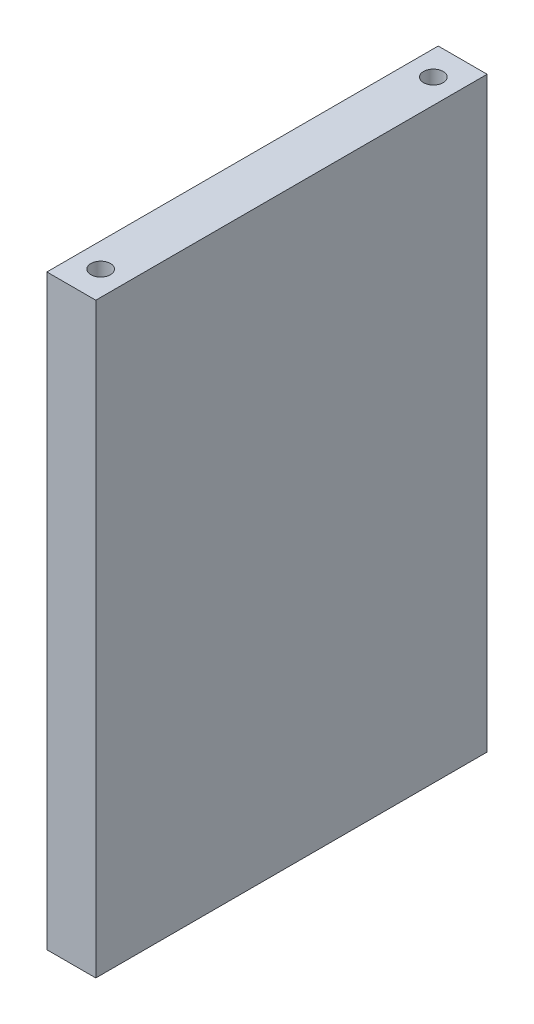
from build123d import *

# Parameters (mm, degrees)
ESQUISSE1_W             = 10
ESQUISSE1_H             = 120
EXTRUSION1_DEPTH        = 80
ESQUISSE2_R             = 2
ENL_V_MAT_EXTRU_1_DEPTH = 10
ESQUISSE4_R             = 2
ENL_V_MAT_EXTRU_2_DEPTH = 10


with BuildPart() as part:
    # Esquisse1 → Extrusion1 (new body)
    with BuildSketch(Plane.XY):
        with Locations((5, 60)):
            Rectangle(ESQUISSE1_W, ESQUISSE1_H)
    extrude(amount=-EXTRUSION1_DEPTH)

    # Esquisse2 → Enl_v. mat.-Extru.1 (cut)
    with BuildSketch(Plane(origin=(0, 120, 0), x_dir=(-1, 0, 0), z_dir=(0, 1, 0))):
        with Locations(Location((-5, -74, 0), (0, 0, 90))):
            Circle(ESQUISSE2_R)
        with Locations(Location((-5, -6, 0), (0, 0, 90))):
            Circle(ESQUISSE2_R)
    extrude(amount=-ENL_V_MAT_EXTRU_1_DEPTH, mode=Mode.SUBTRACT)

    # Esquisse4 → Enl_v. mat.-Extru.2 (cut)
    with BuildSketch(Plane.XZ):
        with Locations(Location((4.974432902, -74, 0), (0, 0, 270))):
            Circle(ESQUISSE4_R)
        with Locations(Location((4.974432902, -6, 0), (0, 0, 270))):
            Circle(ESQUISSE4_R)
    extrude(amount=-ENL_V_MAT_EXTRU_2_DEPTH, mode=Mode.SUBTRACT)


solid = part.part
